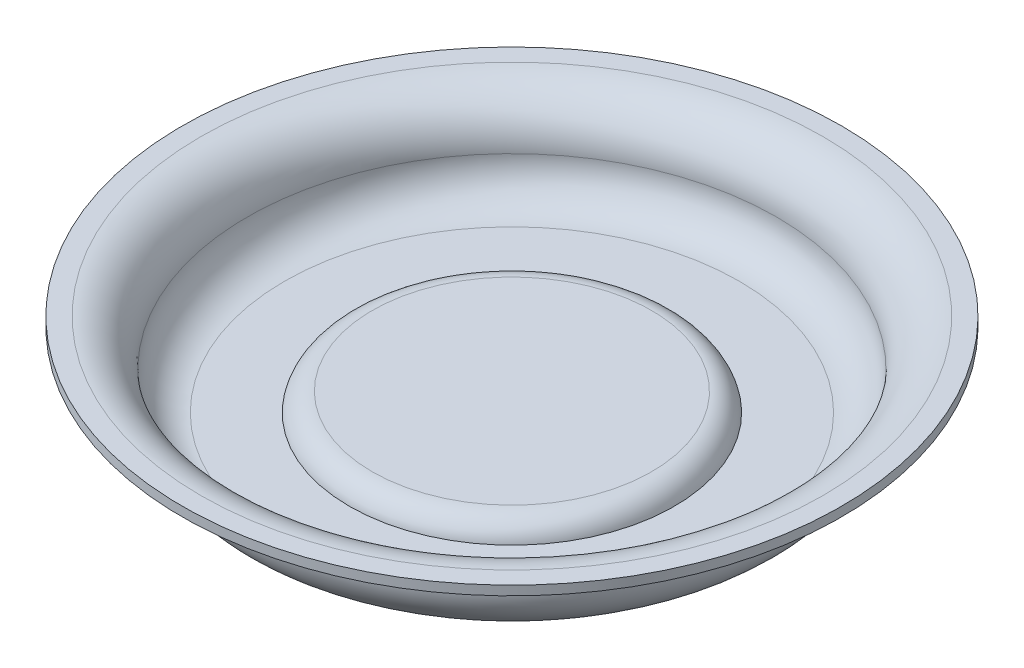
ISO-10303-21;
HEADER;
FILE_DESCRIPTION(('STEP AP214'),'2;1');
FILE_NAME('part.step','',(''),(''),'','','');
FILE_SCHEMA(('AUTOMOTIVE_DESIGN { 1 0 10303 214 1 1 1 1 }'));
ENDSEC;
DATA;
#1=APPLICATION_CONTEXT('core data for automotive mechanical design processes');
#2=APPLICATION_PROTOCOL_DEFINITION('international standard','automotive_design',2000,#1);
#3=PRODUCT_CONTEXT('',#1,'mechanical');
#4=PRODUCT('Part','Part','',(#3));
#5=PRODUCT_RELATED_PRODUCT_CATEGORY('part','',(#4));
#6=PRODUCT_DEFINITION_FORMATION('','',#4);
#7=PRODUCT_DEFINITION_CONTEXT('part definition',#1,'design');
#8=PRODUCT_DEFINITION('design','',#6,#7);
#9=PRODUCT_DEFINITION_SHAPE('','',#8);
#10=(LENGTH_UNIT() NAMED_UNIT(*) SI_UNIT(.MILLI.,.METRE.));
#11=(NAMED_UNIT(*) PLANE_ANGLE_UNIT() SI_UNIT($,.RADIAN.));
#12=(NAMED_UNIT(*) SI_UNIT($,.STERADIAN.) SOLID_ANGLE_UNIT());
#13=UNCERTAINTY_MEASURE_WITH_UNIT(LENGTH_MEASURE(1.E-05),#10,'distance_accuracy_value','');
#14=(GEOMETRIC_REPRESENTATION_CONTEXT(3) GLOBAL_UNCERTAINTY_ASSIGNED_CONTEXT((#13)) GLOBAL_UNIT_ASSIGNED_CONTEXT((#10,
#11,#12)) REPRESENTATION_CONTEXT('',''));
#15=CARTESIAN_POINT('',(0.,0.,0.));
#16=DIRECTION('',(0.,0.,1.));
#17=DIRECTION('',(1.,0.,0.));
#18=AXIS2_PLACEMENT_3D('',#15,#16,#17);
#19=CARTESIAN_POINT('',(28.5,1.,0.));
#20=DIRECTION('',(0.,1.,0.));
#21=DIRECTION('',(0.,0.,1.));
#22=AXIS2_PLACEMENT_3D('',#19,#20,#21);
#23=PLANE('',#22);
#24=CARTESIAN_POINT('',(0.,1.,0.));
#25=DIRECTION('',(0.,1.,0.));
#26=DIRECTION('',(0.,0.,1.));
#27=AXIS2_PLACEMENT_3D('',#24,#25,#26);
#28=CIRCLE('',#27,24.5);
#29=CARTESIAN_POINT('',(0.,1.,24.5));
#30=VERTEX_POINT('',#29);
#31=EDGE_CURVE('E67',#30,#30,#28,.T.);
#32=ORIENTED_EDGE('',*,*,#31,.T.);
#33=EDGE_LOOP('',(#32));
#34=FACE_BOUND('',#33,.T.);
#35=CARTESIAN_POINT('',(0.,1.,0.));
#36=DIRECTION('',(0.,1.,0.));
#37=DIRECTION('',(0.,0.,1.));
#38=AXIS2_PLACEMENT_3D('',#35,#36,#37);
#39=CIRCLE('',#38,17.5);
#40=CARTESIAN_POINT('',(0.,1.,17.5));
#41=VERTEX_POINT('',#40);
#42=EDGE_CURVE('E79',#41,#41,#39,.T.);
#43=ORIENTED_EDGE('',*,*,#42,.F.);
#44=EDGE_LOOP('',(#43));
#45=FACE_BOUND('',#44,.T.);
#46=ADVANCED_FACE('F38',(#34,#45),#23,.T.);
#47=CARTESIAN_POINT('',(0.,0.,0.));
#48=DIRECTION('',(0.,-1.,0.));
#49=DIRECTION('',(0.,0.,-1.));
#50=AXIS2_PLACEMENT_3D('',#47,#48,#49);
#51=PLANE('',#50);
#52=CARTESIAN_POINT('',(0.,0.,0.));
#53=DIRECTION('',(0.,-1.,0.));
#54=DIRECTION('',(0.,0.,-1.));
#55=AXIS2_PLACEMENT_3D('',#52,#53,#54);
#56=CIRCLE('',#55,16.5);
#57=CARTESIAN_POINT('',(0.,0.,-16.5));
#58=VERTEX_POINT('',#57);
#59=EDGE_CURVE('E82',#58,#58,#56,.T.);
#60=ORIENTED_EDGE('',*,*,#59,.F.);
#61=EDGE_LOOP('',(#60));
#62=FACE_BOUND('',#61,.T.);
#63=CARTESIAN_POINT('',(0.,0.,0.));
#64=DIRECTION('',(0.,-1.,0.));
#65=DIRECTION('',(0.,0.,-1.));
#66=AXIS2_PLACEMENT_3D('',#63,#64,#65);
#67=CIRCLE('',#66,24.5);
#68=CARTESIAN_POINT('',(0.,0.,-24.5));
#69=VERTEX_POINT('',#68);
#70=EDGE_CURVE('E64',#69,#69,#67,.T.);
#71=ORIENTED_EDGE('',*,*,#70,.T.);
#72=EDGE_LOOP('',(#71));
#73=FACE_BOUND('',#72,.T.);
#74=ADVANCED_FACE('F40',(#62,#73),#51,.T.);
#75=CARTESIAN_POINT('',(29.5,9.,0.));
#76=DIRECTION('',(0.,-1.,0.));
#77=DIRECTION('',(0.,0.,-1.));
#78=AXIS2_PLACEMENT_3D('',#75,#76,#77);
#79=PLANE('',#78);
#80=CARTESIAN_POINT('',(0.,9.,0.));
#81=DIRECTION('',(0.,-1.,0.));
#82=DIRECTION('',(0.,0.,-1.));
#83=AXIS2_PLACEMENT_3D('',#80,#81,#82);
#84=CIRCLE('',#83,33.5);
#85=CARTESIAN_POINT('',(0.,9.,-33.5));
#86=VERTEX_POINT('',#85);
#87=EDGE_CURVE('E58',#86,#86,#84,.F.);
#88=ORIENTED_EDGE('',*,*,#87,.T.);
#89=EDGE_LOOP('',(#88));
#90=FACE_BOUND('',#89,.T.);
#91=CARTESIAN_POINT('',(0.,9.,0.));
#92=DIRECTION('',(0.,-1.,0.));
#93=DIRECTION('',(0.,0.,-1.));
#94=AXIS2_PLACEMENT_3D('',#91,#92,#93);
#95=CIRCLE('',#94,35.5);
#96=CARTESIAN_POINT('',(0.,9.,-35.5));
#97=VERTEX_POINT('',#96);
#98=EDGE_CURVE('E73',#97,#97,#95,.T.);
#99=ORIENTED_EDGE('',*,*,#98,.T.);
#100=EDGE_LOOP('',(#99));
#101=FACE_BOUND('',#100,.T.);
#102=ADVANCED_FACE('F90',(#90,#101),#79,.T.);
#103=CARTESIAN_POINT('',(0.,0.,0.));
#104=DIRECTION('',(0.,-1.,0.));
#105=DIRECTION('',(0.,0.,-1.));
#106=AXIS2_PLACEMENT_3D('',#103,#104,#105);
#107=CYLINDRICAL_SURFACE('',#106,35.5);
#108=CARTESIAN_POINT('',(0.,10.,0.));
#109=DIRECTION('',(0.,-1.,0.));
#110=DIRECTION('',(0.,0.,-1.));
#111=AXIS2_PLACEMENT_3D('',#108,#109,#110);
#112=CIRCLE('',#111,35.5);
#113=CARTESIAN_POINT('',(0.,10.,-35.5));
#114=VERTEX_POINT('',#113);
#115=EDGE_CURVE('E76',#114,#114,#112,.T.);
#116=ORIENTED_EDGE('',*,*,#115,.T.);
#117=EDGE_LOOP('',(#116));
#118=FACE_BOUND('',#117,.T.);
#119=ORIENTED_EDGE('',*,*,#98,.F.);
#120=EDGE_LOOP('',(#119));
#121=FACE_BOUND('',#120,.T.);
#122=ADVANCED_FACE('F119',(#118,#121),#107,.T.);
#123=CARTESIAN_POINT('',(35.5,10.,0.));
#124=DIRECTION('',(0.,1.,0.));
#125=DIRECTION('',(0.,0.,1.));
#126=AXIS2_PLACEMENT_3D('',#123,#124,#125);
#127=PLANE('',#126);
#128=CARTESIAN_POINT('',(0.,10.,0.));
#129=DIRECTION('',(0.,1.,0.));
#130=DIRECTION('',(0.,0.,1.));
#131=AXIS2_PLACEMENT_3D('',#128,#129,#130);
#132=CIRCLE('',#131,33.5);
#133=CARTESIAN_POINT('',(0.,10.,33.5));
#134=VERTEX_POINT('',#133);
#135=EDGE_CURVE('E53',#134,#134,#132,.F.);
#136=ORIENTED_EDGE('',*,*,#135,.T.);
#137=EDGE_LOOP('',(#136));
#138=FACE_BOUND('',#137,.T.);
#139=ORIENTED_EDGE('',*,*,#115,.F.);
#140=EDGE_LOOP('',(#139));
#141=FACE_BOUND('',#140,.T.);
#142=ADVANCED_FACE('F106',(#138,#141),#127,.T.);
#143=CARTESIAN_POINT('',(0.,5.,0.));
#144=DIRECTION('',(0.,1.,0.));
#145=DIRECTION('',(0.,0.,1.));
#146=AXIS2_PLACEMENT_3D('',#143,#144,#145);
#147=TOROIDAL_SURFACE('',#146,24.5,4.);
#148=ORIENTED_EDGE('',*,*,#31,.F.);
#149=EDGE_LOOP('',(#148));
#150=FACE_BOUND('',#149,.T.);
#151=CARTESIAN_POINT('',(0.,5.,0.));
#152=DIRECTION('',(0.,1.,0.));
#153=DIRECTION('',(0.,0.,1.));
#154=AXIS2_PLACEMENT_3D('',#151,#152,#153);
#155=CIRCLE('',#154,28.5);
#156=CARTESIAN_POINT('',(0.,5.,28.5));
#157=VERTEX_POINT('',#156);
#158=EDGE_CURVE('E70',#157,#157,#155,.F.);
#159=ORIENTED_EDGE('',*,*,#158,.F.);
#160=EDGE_LOOP('',(#159));
#161=FACE_BOUND('',#160,.T.);
#162=ADVANCED_FACE('F96',(#150,#161),#147,.F.);
#163=CARTESIAN_POINT('',(0.,5.,0.));
#164=DIRECTION('',(0.,-1.,0.));
#165=DIRECTION('',(0.,0.,-1.));
#166=AXIS2_PLACEMENT_3D('',#163,#164,#165);
#167=TOROIDAL_SURFACE('',#166,24.5,5.);
#168=CARTESIAN_POINT('',(0.,5.,0.));
#169=DIRECTION('',(0.,-1.,0.));
#170=DIRECTION('',(0.,0.,-1.));
#171=AXIS2_PLACEMENT_3D('',#168,#169,#170);
#172=CIRCLE('',#171,29.5);
#173=CARTESIAN_POINT('',(0.,5.,-29.5));
#174=VERTEX_POINT('',#173);
#175=EDGE_CURVE('E61',#174,#174,#172,.F.);
#176=ORIENTED_EDGE('',*,*,#175,.F.);
#177=EDGE_LOOP('',(#176));
#178=FACE_BOUND('',#177,.T.);
#179=ORIENTED_EDGE('',*,*,#70,.F.);
#180=EDGE_LOOP('',(#179));
#181=FACE_BOUND('',#180,.T.);
#182=ADVANCED_FACE('F93',(#178,#181),#167,.T.);
#183=CARTESIAN_POINT('',(0.,5.,0.));
#184=DIRECTION('',(0.,-1.,0.));
#185=DIRECTION('',(0.,0.,-1.));
#186=AXIS2_PLACEMENT_3D('',#183,#184,#185);
#187=TOROIDAL_SURFACE('',#186,33.5,4.);
#188=ORIENTED_EDGE('',*,*,#87,.F.);
#189=EDGE_LOOP('',(#188));
#190=FACE_BOUND('',#189,.T.);
#191=ORIENTED_EDGE('',*,*,#175,.T.);
#192=EDGE_LOOP('',(#191));
#193=FACE_BOUND('',#192,.T.);
#194=ADVANCED_FACE('F95',(#190,#193),#187,.F.);
#195=CARTESIAN_POINT('',(0.,5.,0.));
#196=DIRECTION('',(0.,1.,0.));
#197=DIRECTION('',(0.,0.,1.));
#198=AXIS2_PLACEMENT_3D('',#195,#196,#197);
#199=TOROIDAL_SURFACE('',#198,33.5,5.);
#200=ORIENTED_EDGE('',*,*,#158,.T.);
#201=EDGE_LOOP('',(#200));
#202=FACE_BOUND('',#201,.T.);
#203=ORIENTED_EDGE('',*,*,#135,.F.);
#204=EDGE_LOOP('',(#203));
#205=FACE_BOUND('',#204,.T.);
#206=ADVANCED_FACE('F103',(#202,#205),#199,.T.);
#207=CARTESIAN_POINT('',(0.,3.,0.));
#208=DIRECTION('',(0.,1.,0.));
#209=DIRECTION('',(0.,0.,1.));
#210=AXIS2_PLACEMENT_3D('',#207,#208,#209);
#211=PLANE('',#210);
#212=CARTESIAN_POINT('',(0.,3.,0.));
#213=DIRECTION('',(0.,1.,0.));
#214=DIRECTION('',(0.,0.,1.));
#215=AXIS2_PLACEMENT_3D('',#212,#213,#214);
#216=CIRCLE('',#215,15.0505102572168);
#217=CARTESIAN_POINT('',(0.,3.,15.0505102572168));
#218=VERTEX_POINT('',#217);
#219=EDGE_CURVE('E49',#218,#218,#216,.T.);
#220=ORIENTED_EDGE('',*,*,#219,.T.);
#221=EDGE_LOOP('',(#220));
#222=FACE_BOUND('',#221,.T.);
#223=ADVANCED_FACE('F165',(#222),#211,.T.);
#224=CARTESIAN_POINT('',(0.,0.500000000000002,0.));
#225=DIRECTION('',(0.,-1.,0.));
#226=DIRECTION('',(0.,0.,-1.));
#227=AXIS2_PLACEMENT_3D('',#224,#225,#226);
#228=TOROIDAL_SURFACE('',#227,15.0505102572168,2.5);
#229=ORIENTED_EDGE('',*,*,#42,.T.);
#230=EDGE_LOOP('',(#229));
#231=FACE_BOUND('',#230,.T.);
#232=ORIENTED_EDGE('',*,*,#219,.F.);
#233=EDGE_LOOP('',(#232));
#234=FACE_BOUND('',#233,.T.);
#235=ADVANCED_FACE('F176',(#231,#234),#228,.T.);
#236=CARTESIAN_POINT('',(0.,2.,0.));
#237=DIRECTION('',(0.,-1.,0.));
#238=DIRECTION('',(0.,0.,-1.));
#239=AXIS2_PLACEMENT_3D('',#236,#237,#238);
#240=CYLINDRICAL_SURFACE('',#239,16.5);
#241=CARTESIAN_POINT('',(0.,0.5,0.));
#242=DIRECTION('',(0.,-1.,0.));
#243=DIRECTION('',(0.,0.,-1.));
#244=AXIS2_PLACEMENT_3D('',#241,#242,#243);
#245=CIRCLE('',#244,16.5);
#246=CARTESIAN_POINT('',(0.,0.5,-16.5));
#247=VERTEX_POINT('',#246);
#248=EDGE_CURVE('E12',#247,#247,#245,.F.);
#249=ORIENTED_EDGE('',*,*,#248,.T.);
#250=EDGE_LOOP('',(#249));
#251=FACE_BOUND('',#250,.T.);
#252=ORIENTED_EDGE('',*,*,#59,.T.);
#253=EDGE_LOOP('',(#252));
#254=FACE_BOUND('',#253,.T.);
#255=ADVANCED_FACE('F86',(#251,#254),#240,.F.);
#256=CARTESIAN_POINT('',(0.,2.,0.));
#257=DIRECTION('',(0.,-1.,0.));
#258=DIRECTION('',(0.,0.,-1.));
#259=AXIS2_PLACEMENT_3D('',#256,#257,#258);
#260=PLANE('',#259);
#261=CARTESIAN_POINT('',(0.,2.,0.));
#262=DIRECTION('',(0.,-1.,0.));
#263=DIRECTION('',(0.,0.,-1.));
#264=AXIS2_PLACEMENT_3D('',#261,#262,#263);
#265=CIRCLE('',#264,15.);
#266=CARTESIAN_POINT('',(0.,2.,-15.));
#267=VERTEX_POINT('',#266);
#268=EDGE_CURVE('E45',#267,#267,#265,.T.);
#269=ORIENTED_EDGE('',*,*,#268,.T.);
#270=EDGE_LOOP('',(#269));
#271=FACE_BOUND('',#270,.T.);
#272=ADVANCED_FACE('F195',(#271),#260,.T.);
#273=CARTESIAN_POINT('',(0.,0.5,0.));
#274=DIRECTION('',(0.,-1.,0.));
#275=DIRECTION('',(0.,0.,-1.));
#276=AXIS2_PLACEMENT_3D('',#273,#274,#275);
#277=TOROIDAL_SURFACE('',#276,15.,1.5);
#278=ORIENTED_EDGE('',*,*,#248,.F.);
#279=EDGE_LOOP('',(#278));
#280=FACE_BOUND('',#279,.T.);
#281=ORIENTED_EDGE('',*,*,#268,.F.);
#282=EDGE_LOOP('',(#281));
#283=FACE_BOUND('',#282,.T.);
#284=ADVANCED_FACE('F204',(#280,#283),#277,.F.);
#285=CLOSED_SHELL('',(#46,#74,#102,#122,#142,#162,#182,#194,#206,#223,#235,#255,#272,#284));
#286=MANIFOLD_SOLID_BREP('B2',#285);
#287=ADVANCED_BREP_SHAPE_REPRESENTATION('',(#18,#286),#14);
#288=SHAPE_DEFINITION_REPRESENTATION(#9,#287);
ENDSEC;
END-ISO-10303-21;
